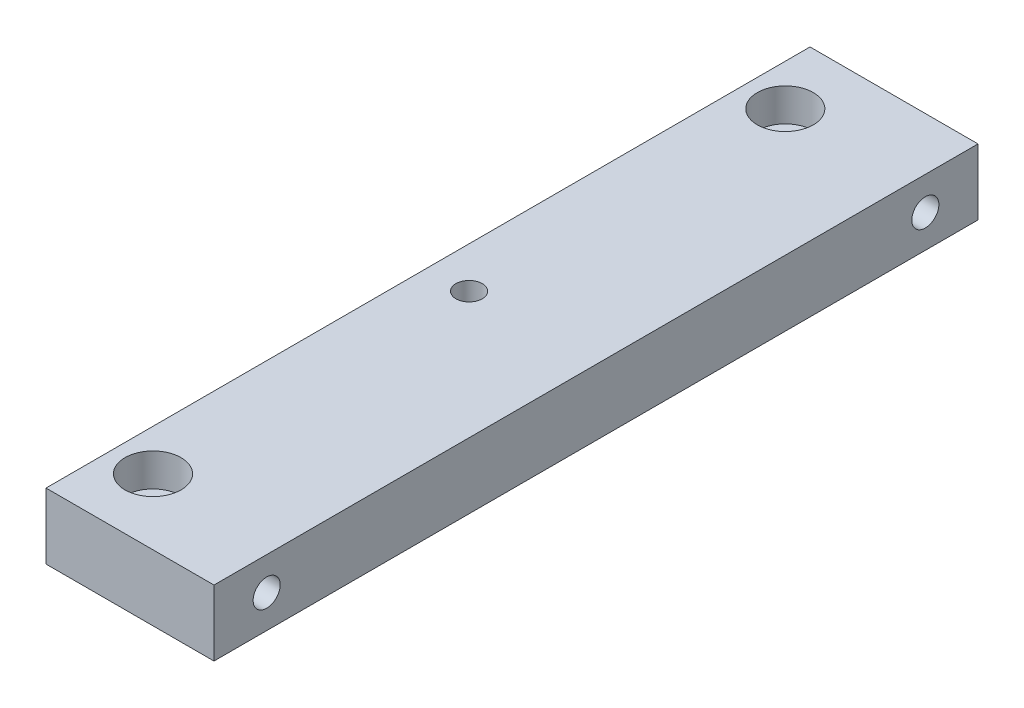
ISO-10303-21;
HEADER;
FILE_DESCRIPTION(('STEP AP214'),'2;1');
FILE_NAME('part.step','',(''),(''),'','','');
FILE_SCHEMA(('AUTOMOTIVE_DESIGN { 1 0 10303 214 1 1 1 1 }'));
ENDSEC;
DATA;
#1=APPLICATION_CONTEXT('core data for automotive mechanical design processes');
#2=APPLICATION_PROTOCOL_DEFINITION('international standard','automotive_design',2000,#1);
#3=PRODUCT_CONTEXT('',#1,'mechanical');
#4=PRODUCT('Part','Part','',(#3));
#5=PRODUCT_RELATED_PRODUCT_CATEGORY('part','',(#4));
#6=PRODUCT_DEFINITION_FORMATION('','',#4);
#7=PRODUCT_DEFINITION_CONTEXT('part definition',#1,'design');
#8=PRODUCT_DEFINITION('design','',#6,#7);
#9=PRODUCT_DEFINITION_SHAPE('','',#8);
#10=(LENGTH_UNIT() NAMED_UNIT(*) SI_UNIT(.MILLI.,.METRE.));
#11=(NAMED_UNIT(*) PLANE_ANGLE_UNIT() SI_UNIT($,.RADIAN.));
#12=(NAMED_UNIT(*) SI_UNIT($,.STERADIAN.) SOLID_ANGLE_UNIT());
#13=UNCERTAINTY_MEASURE_WITH_UNIT(LENGTH_MEASURE(1.E-05),#10,'distance_accuracy_value','');
#14=(GEOMETRIC_REPRESENTATION_CONTEXT(3) GLOBAL_UNCERTAINTY_ASSIGNED_CONTEXT((#13)) GLOBAL_UNIT_ASSIGNED_CONTEXT((#10,
#11,#12)) REPRESENTATION_CONTEXT('',''));
#15=CARTESIAN_POINT('',(0.,0.,0.));
#16=DIRECTION('',(0.,0.,1.));
#17=DIRECTION('',(1.,0.,0.));
#18=AXIS2_PLACEMENT_3D('',#15,#16,#17);
#19=CARTESIAN_POINT('',(20.2438,7.9375,-92.075));
#20=DIRECTION('',(-1.,0.,0.));
#21=DIRECTION('',(0.,0.,1.));
#22=AXIS2_PLACEMENT_3D('',#19,#20,#21);
#23=PLANE('',#22);
#24=CARTESIAN_POINT('',(20.2438,0.,-79.375));
#25=DIRECTION('',(1.,0.,0.));
#26=DIRECTION('',(0.,0.,-1.));
#27=AXIS2_PLACEMENT_3D('',#24,#25,#26);
#28=CIRCLE('',#27,3.2639);
#29=CARTESIAN_POINT('',(20.2438,0.,-82.6389));
#30=VERTEX_POINT('',#29);
#31=EDGE_CURVE('E104',#30,#30,#28,.T.);
#32=ORIENTED_EDGE('',*,*,#31,.F.);
#33=EDGE_LOOP('',(#32));
#34=FACE_BOUND('',#33,.T.);
#35=CARTESIAN_POINT('',(20.2438,0.,79.375));
#36=DIRECTION('',(1.,0.,0.));
#37=DIRECTION('',(0.,0.,-1.));
#38=AXIS2_PLACEMENT_3D('',#35,#36,#37);
#39=CIRCLE('',#38,3.2639);
#40=CARTESIAN_POINT('',(20.2438,0.,76.1111));
#41=VERTEX_POINT('',#40);
#42=EDGE_CURVE('E103',#41,#41,#39,.T.);
#43=ORIENTED_EDGE('',*,*,#42,.F.);
#44=EDGE_LOOP('',(#43));
#45=FACE_BOUND('',#44,.T.);
#46=DIRECTION('',(0.,0.,-1.));
#47=VECTOR('',#46,1.);
#48=CARTESIAN_POINT('',(20.2438,-7.9375,-92.075));
#49=LINE('',#48,#47);
#50=CARTESIAN_POINT('',(20.2438,-7.9375,92.075));
#51=VERTEX_POINT('',#50);
#52=CARTESIAN_POINT('',(20.2438,-7.9375,-92.075));
#53=VERTEX_POINT('',#52);
#54=EDGE_CURVE('E144',#51,#53,#49,.T.);
#55=ORIENTED_EDGE('',*,*,#54,.T.);
#56=DIRECTION('',(0.,-1.,0.));
#57=VECTOR('',#56,1.);
#58=CARTESIAN_POINT('',(20.2438,7.9375,-92.075));
#59=LINE('',#58,#57);
#60=CARTESIAN_POINT('',(20.2438,7.9375,-92.075));
#61=VERTEX_POINT('',#60);
#62=EDGE_CURVE('E11',#61,#53,#59,.T.);
#63=ORIENTED_EDGE('',*,*,#62,.F.);
#64=DIRECTION('',(0.,0.,-1.));
#65=VECTOR('',#64,1.);
#66=CARTESIAN_POINT('',(20.2438,7.9375,-92.075));
#67=LINE('',#66,#65);
#68=CARTESIAN_POINT('',(20.2438,7.9375,92.075));
#69=VERTEX_POINT('',#68);
#70=EDGE_CURVE('E145',#69,#61,#67,.T.);
#71=ORIENTED_EDGE('',*,*,#70,.F.);
#72=DIRECTION('',(0.,-1.,0.));
#73=VECTOR('',#72,1.);
#74=CARTESIAN_POINT('',(20.2438,7.9375,92.075));
#75=LINE('',#74,#73);
#76=EDGE_CURVE('E151',#69,#51,#75,.T.);
#77=ORIENTED_EDGE('',*,*,#76,.T.);
#78=EDGE_LOOP('',(#55,#63,#71,#77));
#79=FACE_BOUND('',#78,.T.);
#80=ADVANCED_FACE('F39',(#34,#45,#79),#23,.F.);
#81=CARTESIAN_POINT('',(-20.2438,7.9375,-92.075));
#82=DIRECTION('',(0.,0.,1.));
#83=DIRECTION('',(1.,0.,0.));
#84=AXIS2_PLACEMENT_3D('',#81,#82,#83);
#85=PLANE('',#84);
#86=DIRECTION('',(-1.,0.,0.));
#87=VECTOR('',#86,1.);
#88=CARTESIAN_POINT('',(-20.2438,-7.9375,-92.075));
#89=LINE('',#88,#87);
#90=CARTESIAN_POINT('',(-20.2438,-7.9375,-92.075));
#91=VERTEX_POINT('',#90);
#92=EDGE_CURVE('E154',#53,#91,#89,.T.);
#93=ORIENTED_EDGE('',*,*,#92,.T.);
#94=DIRECTION('',(0.,-1.,0.));
#95=VECTOR('',#94,1.);
#96=CARTESIAN_POINT('',(-20.2438,7.9375,-92.075));
#97=LINE('',#96,#95);
#98=CARTESIAN_POINT('',(-20.2438,7.9375,-92.075));
#99=VERTEX_POINT('',#98);
#100=EDGE_CURVE('E47',#99,#91,#97,.T.);
#101=ORIENTED_EDGE('',*,*,#100,.F.);
#102=DIRECTION('',(-1.,0.,0.));
#103=VECTOR('',#102,1.);
#104=CARTESIAN_POINT('',(-20.2438,7.9375,-92.075));
#105=LINE('',#104,#103);
#106=EDGE_CURVE('E86',#61,#99,#105,.T.);
#107=ORIENTED_EDGE('',*,*,#106,.F.);
#108=ORIENTED_EDGE('',*,*,#62,.T.);
#109=EDGE_LOOP('',(#93,#101,#107,#108));
#110=FACE_BOUND('',#109,.T.);
#111=ADVANCED_FACE('F178',(#110),#85,.F.);
#112=CARTESIAN_POINT('',(-20.2438,7.9375,-92.075));
#113=DIRECTION('',(1.,0.,0.));
#114=DIRECTION('',(0.,0.,-1.));
#115=AXIS2_PLACEMENT_3D('',#112,#113,#114);
#116=PLANE('',#115);
#117=DIRECTION('',(0.,0.,1.));
#118=VECTOR('',#117,1.);
#119=CARTESIAN_POINT('',(-20.2438,-7.9375,-92.075));
#120=LINE('',#119,#118);
#121=CARTESIAN_POINT('',(-20.2438,-7.9375,92.075));
#122=VERTEX_POINT('',#121);
#123=EDGE_CURVE('E73',#91,#122,#120,.T.);
#124=ORIENTED_EDGE('',*,*,#123,.T.);
#125=DIRECTION('',(0.,-1.,0.));
#126=VECTOR('',#125,1.);
#127=CARTESIAN_POINT('',(-20.2438,7.9375,92.075));
#128=LINE('',#127,#126);
#129=CARTESIAN_POINT('',(-20.2438,7.9375,92.075));
#130=VERTEX_POINT('',#129);
#131=EDGE_CURVE('E159',#130,#122,#128,.T.);
#132=ORIENTED_EDGE('',*,*,#131,.F.);
#133=DIRECTION('',(0.,0.,1.));
#134=VECTOR('',#133,1.);
#135=CARTESIAN_POINT('',(-20.2438,7.9375,-92.075));
#136=LINE('',#135,#134);
#137=EDGE_CURVE('E148',#99,#130,#136,.T.);
#138=ORIENTED_EDGE('',*,*,#137,.F.);
#139=ORIENTED_EDGE('',*,*,#100,.T.);
#140=EDGE_LOOP('',(#124,#132,#138,#139));
#141=FACE_BOUND('',#140,.T.);
#142=ADVANCED_FACE('F161',(#141),#116,.F.);
#143=CARTESIAN_POINT('',(-20.2438,7.9375,92.075));
#144=DIRECTION('',(0.,0.,-1.));
#145=DIRECTION('',(-1.,0.,0.));
#146=AXIS2_PLACEMENT_3D('',#143,#144,#145);
#147=PLANE('',#146);
#148=DIRECTION('',(1.,0.,0.));
#149=VECTOR('',#148,1.);
#150=CARTESIAN_POINT('',(-20.2438,-7.9375,92.075));
#151=LINE('',#150,#149);
#152=EDGE_CURVE('E79',#122,#51,#151,.T.);
#153=ORIENTED_EDGE('',*,*,#152,.T.);
#154=ORIENTED_EDGE('',*,*,#76,.F.);
#155=DIRECTION('',(1.,0.,0.));
#156=VECTOR('',#155,1.);
#157=CARTESIAN_POINT('',(-20.2438,7.9375,92.075));
#158=LINE('',#157,#156);
#159=EDGE_CURVE('E55',#130,#69,#158,.T.);
#160=ORIENTED_EDGE('',*,*,#159,.F.);
#161=ORIENTED_EDGE('',*,*,#131,.T.);
#162=EDGE_LOOP('',(#153,#154,#160,#161));
#163=FACE_BOUND('',#162,.T.);
#164=ADVANCED_FACE('F168',(#163),#147,.F.);
#165=CARTESIAN_POINT('',(0.,7.9375,0.));
#166=DIRECTION('',(0.,1.,0.));
#167=DIRECTION('',(0.,0.,1.));
#168=AXIS2_PLACEMENT_3D('',#165,#166,#167);
#169=PLANE('',#168);
#170=CARTESIAN_POINT('',(-10.3362074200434,7.9375,1.07876481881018E-11));
#171=DIRECTION('',(0.,-1.,0.));
#172=DIRECTION('',(0.,0.,-1.));
#173=AXIS2_PLACEMENT_3D('',#170,#171,#172);
#174=CIRCLE('',#173,3.175);
#175=CARTESIAN_POINT('',(-10.3362074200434,7.9375,-3.17499999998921));
#176=VERTEX_POINT('',#175);
#177=EDGE_CURVE('E117',#176,#176,#174,.T.);
#178=ORIENTED_EDGE('',*,*,#177,.T.);
#179=EDGE_LOOP('',(#178));
#180=FACE_BOUND('',#179,.T.);
#181=CARTESIAN_POINT('',(-10.3235074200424,7.9375,76.2000000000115));
#182=DIRECTION('',(0.,1.,0.));
#183=DIRECTION('',(0.,0.,1.));
#184=AXIS2_PLACEMENT_3D('',#181,#182,#183);
#185=CIRCLE('',#184,6.74751);
#186=CARTESIAN_POINT('',(-10.3235074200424,7.9375,82.9475100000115));
#187=VERTEX_POINT('',#186);
#188=EDGE_CURVE('E120',#187,#187,#185,.T.);
#189=ORIENTED_EDGE('',*,*,#188,.F.);
#190=EDGE_LOOP('',(#189));
#191=FACE_BOUND('',#190,.T.);
#192=CARTESIAN_POINT('',(-10.3235074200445,7.9375,-76.1999999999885));
#193=DIRECTION('',(0.,1.,0.));
#194=DIRECTION('',(0.,0.,1.));
#195=AXIS2_PLACEMENT_3D('',#192,#193,#194);
#196=CIRCLE('',#195,6.74751);
#197=CARTESIAN_POINT('',(-10.3235074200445,7.9375,-69.4524899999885));
#198=VERTEX_POINT('',#197);
#199=EDGE_CURVE('E132',#198,#198,#196,.T.);
#200=ORIENTED_EDGE('',*,*,#199,.F.);
#201=EDGE_LOOP('',(#200));
#202=FACE_BOUND('',#201,.T.);
#203=ORIENTED_EDGE('',*,*,#70,.T.);
#204=ORIENTED_EDGE('',*,*,#106,.T.);
#205=ORIENTED_EDGE('',*,*,#137,.T.);
#206=ORIENTED_EDGE('',*,*,#159,.T.);
#207=EDGE_LOOP('',(#203,#204,#205,#206));
#208=FACE_BOUND('',#207,.T.);
#209=ADVANCED_FACE('F170',(#180,#191,#202,#208),#169,.T.);
#210=CARTESIAN_POINT('',(0.,-7.9375,0.));
#211=DIRECTION('',(0.,1.,0.));
#212=DIRECTION('',(0.,0.,1.));
#213=AXIS2_PLACEMENT_3D('',#210,#211,#212);
#214=PLANE('',#213);
#215=CARTESIAN_POINT('',(-10.3362074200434,-7.9375,1.07876481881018E-11));
#216=DIRECTION('',(0.,-1.,0.));
#217=DIRECTION('',(0.,0.,-1.));
#218=AXIS2_PLACEMENT_3D('',#215,#216,#217);
#219=CIRCLE('',#218,3.175);
#220=CARTESIAN_POINT('',(-10.3362074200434,-7.9375,-3.17499999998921));
#221=VERTEX_POINT('',#220);
#222=EDGE_CURVE('E114',#221,#221,#219,.T.);
#223=ORIENTED_EDGE('',*,*,#222,.F.);
#224=EDGE_LOOP('',(#223));
#225=FACE_BOUND('',#224,.T.);
#226=CARTESIAN_POINT('',(-10.3235074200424,-7.9375,76.2000000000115));
#227=DIRECTION('',(0.,1.,0.));
#228=DIRECTION('',(0.,0.,1.));
#229=AXIS2_PLACEMENT_3D('',#226,#227,#228);
#230=CIRCLE('',#229,4.2164);
#231=CARTESIAN_POINT('',(-10.3235074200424,-7.9375,80.4164000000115));
#232=VERTEX_POINT('',#231);
#233=EDGE_CURVE('E129',#232,#232,#230,.T.);
#234=ORIENTED_EDGE('',*,*,#233,.T.);
#235=EDGE_LOOP('',(#234));
#236=FACE_BOUND('',#235,.T.);
#237=CARTESIAN_POINT('',(-10.3235074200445,-7.9375,-76.1999999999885));
#238=DIRECTION('',(0.,1.,0.));
#239=DIRECTION('',(0.,0.,1.));
#240=AXIS2_PLACEMENT_3D('',#237,#238,#239);
#241=CIRCLE('',#240,4.2164);
#242=CARTESIAN_POINT('',(-10.3235074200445,-7.9375,-71.9835999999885));
#243=VERTEX_POINT('',#242);
#244=EDGE_CURVE('E141',#243,#243,#241,.T.);
#245=ORIENTED_EDGE('',*,*,#244,.T.);
#246=EDGE_LOOP('',(#245));
#247=FACE_BOUND('',#246,.T.);
#248=ORIENTED_EDGE('',*,*,#54,.F.);
#249=ORIENTED_EDGE('',*,*,#152,.F.);
#250=ORIENTED_EDGE('',*,*,#123,.F.);
#251=ORIENTED_EDGE('',*,*,#92,.F.);
#252=EDGE_LOOP('',(#248,#249,#250,#251));
#253=FACE_BOUND('',#252,.T.);
#254=ADVANCED_FACE('F164',(#225,#236,#247,#253),#214,.F.);
#255=CARTESIAN_POINT('',(-10.3235074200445,7.9375,-76.1999999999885));
#256=DIRECTION('',(0.,1.,0.));
#257=DIRECTION('',(0.,0.,1.));
#258=AXIS2_PLACEMENT_3D('',#255,#256,#257);
#259=CYLINDRICAL_SURFACE('',#258,4.2164);
#260=ORIENTED_EDGE('',*,*,#244,.F.);
#261=EDGE_LOOP('',(#260));
#262=FACE_BOUND('',#261,.T.);
#263=CARTESIAN_POINT('',(-10.3235074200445,0.,-76.1999999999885));
#264=DIRECTION('',(0.,1.,0.));
#265=DIRECTION('',(0.,0.,1.));
#266=AXIS2_PLACEMENT_3D('',#263,#264,#265);
#267=CIRCLE('',#266,4.2164);
#268=CARTESIAN_POINT('',(-10.3235074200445,0.,-71.9835999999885));
#269=VERTEX_POINT('',#268);
#270=EDGE_CURVE('E138',#269,#269,#267,.T.);
#271=ORIENTED_EDGE('',*,*,#270,.T.);
#272=EDGE_LOOP('',(#271));
#273=FACE_BOUND('',#272,.T.);
#274=ADVANCED_FACE('F225',(#262,#273),#259,.F.);
#275=CARTESIAN_POINT('',(-6.10710742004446,0.,-76.1999999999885));
#276=DIRECTION('',(0.,-1.,0.));
#277=DIRECTION('',(0.,0.,-1.));
#278=AXIS2_PLACEMENT_3D('',#275,#276,#277);
#279=PLANE('',#278);
#280=ORIENTED_EDGE('',*,*,#270,.F.);
#281=EDGE_LOOP('',(#280));
#282=FACE_BOUND('',#281,.T.);
#283=CARTESIAN_POINT('',(-10.3235074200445,0.,-76.1999999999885));
#284=DIRECTION('',(0.,1.,0.));
#285=DIRECTION('',(0.,0.,1.));
#286=AXIS2_PLACEMENT_3D('',#283,#284,#285);
#287=CIRCLE('',#286,6.74751);
#288=CARTESIAN_POINT('',(-10.3235074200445,0.,-69.4524899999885));
#289=VERTEX_POINT('',#288);
#290=EDGE_CURVE('E135',#289,#289,#287,.T.);
#291=ORIENTED_EDGE('',*,*,#290,.T.);
#292=EDGE_LOOP('',(#291));
#293=FACE_BOUND('',#292,.T.);
#294=ADVANCED_FACE('F221',(#282,#293),#279,.F.);
#295=CARTESIAN_POINT('',(-10.3235074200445,7.9375,-76.1999999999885));
#296=DIRECTION('',(0.,1.,0.));
#297=DIRECTION('',(0.,0.,1.));
#298=AXIS2_PLACEMENT_3D('',#295,#296,#297);
#299=CYLINDRICAL_SURFACE('',#298,6.74751);
#300=ORIENTED_EDGE('',*,*,#290,.F.);
#301=EDGE_LOOP('',(#300));
#302=FACE_BOUND('',#301,.T.);
#303=ORIENTED_EDGE('',*,*,#199,.T.);
#304=EDGE_LOOP('',(#303));
#305=FACE_BOUND('',#304,.T.);
#306=ADVANCED_FACE('F217',(#302,#305),#299,.F.);
#307=CARTESIAN_POINT('',(-10.3235074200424,7.9375,76.2000000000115));
#308=DIRECTION('',(0.,1.,0.));
#309=DIRECTION('',(0.,0.,1.));
#310=AXIS2_PLACEMENT_3D('',#307,#308,#309);
#311=CYLINDRICAL_SURFACE('',#310,4.2164);
#312=ORIENTED_EDGE('',*,*,#233,.F.);
#313=EDGE_LOOP('',(#312));
#314=FACE_BOUND('',#313,.T.);
#315=CARTESIAN_POINT('',(-10.3235074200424,0.,76.2000000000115));
#316=DIRECTION('',(0.,1.,0.));
#317=DIRECTION('',(0.,0.,1.));
#318=AXIS2_PLACEMENT_3D('',#315,#316,#317);
#319=CIRCLE('',#318,4.2164);
#320=CARTESIAN_POINT('',(-10.3235074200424,0.,80.4164000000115));
#321=VERTEX_POINT('',#320);
#322=EDGE_CURVE('E126',#321,#321,#319,.T.);
#323=ORIENTED_EDGE('',*,*,#322,.T.);
#324=EDGE_LOOP('',(#323));
#325=FACE_BOUND('',#324,.T.);
#326=ADVANCED_FACE('F213',(#314,#325),#311,.F.);
#327=CARTESIAN_POINT('',(-6.10710742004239,0.,76.2000000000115));
#328=DIRECTION('',(0.,-1.,0.));
#329=DIRECTION('',(0.,0.,-1.));
#330=AXIS2_PLACEMENT_3D('',#327,#328,#329);
#331=PLANE('',#330);
#332=ORIENTED_EDGE('',*,*,#322,.F.);
#333=EDGE_LOOP('',(#332));
#334=FACE_BOUND('',#333,.T.);
#335=CARTESIAN_POINT('',(-10.3235074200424,0.,76.2000000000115));
#336=DIRECTION('',(0.,1.,0.));
#337=DIRECTION('',(0.,0.,1.));
#338=AXIS2_PLACEMENT_3D('',#335,#336,#337);
#339=CIRCLE('',#338,6.74751);
#340=CARTESIAN_POINT('',(-10.3235074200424,0.,82.9475100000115));
#341=VERTEX_POINT('',#340);
#342=EDGE_CURVE('E123',#341,#341,#339,.T.);
#343=ORIENTED_EDGE('',*,*,#342,.T.);
#344=EDGE_LOOP('',(#343));
#345=FACE_BOUND('',#344,.T.);
#346=ADVANCED_FACE('F209',(#334,#345),#331,.F.);
#347=CARTESIAN_POINT('',(-10.3235074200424,7.9375,76.2000000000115));
#348=DIRECTION('',(0.,1.,0.));
#349=DIRECTION('',(0.,0.,1.));
#350=AXIS2_PLACEMENT_3D('',#347,#348,#349);
#351=CYLINDRICAL_SURFACE('',#350,6.74751);
#352=ORIENTED_EDGE('',*,*,#342,.F.);
#353=EDGE_LOOP('',(#352));
#354=FACE_BOUND('',#353,.T.);
#355=ORIENTED_EDGE('',*,*,#188,.T.);
#356=EDGE_LOOP('',(#355));
#357=FACE_BOUND('',#356,.T.);
#358=ADVANCED_FACE('F205',(#354,#357),#351,.F.);
#359=CARTESIAN_POINT('',(-10.3362074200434,-7.9375,1.07876481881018E-11));
#360=DIRECTION('',(0.,-1.,0.));
#361=DIRECTION('',(0.,0.,-1.));
#362=AXIS2_PLACEMENT_3D('',#359,#360,#361);
#363=CYLINDRICAL_SURFACE('',#362,3.175);
#364=ORIENTED_EDGE('',*,*,#177,.F.);
#365=EDGE_LOOP('',(#364));
#366=FACE_BOUND('',#365,.T.);
#367=ORIENTED_EDGE('',*,*,#222,.T.);
#368=EDGE_LOOP('',(#367));
#369=FACE_BOUND('',#368,.T.);
#370=ADVANCED_FACE('F197',(#366,#369),#363,.F.);
#371=CARTESIAN_POINT('',(-0.0762000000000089,0.,79.375));
#372=DIRECTION('',(1.,0.,0.));
#373=DIRECTION('',(0.,0.,-1.));
#374=AXIS2_PLACEMENT_3D('',#371,#372,#373);
#375=CONICAL_SURFACE('',#374,3.2639,1.02974425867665);
#376=CARTESIAN_POINT('',(-2.03734897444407,0.,79.375));
#377=VERTEX_POINT('',#376);
#378=VERTEX_LOOP('',#377);
#379=FACE_BOUND('',#378,.T.);
#380=CARTESIAN_POINT('',(-0.0762000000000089,0.,79.375));
#381=DIRECTION('',(1.,0.,0.));
#382=DIRECTION('',(0.,0.,-1.));
#383=AXIS2_PLACEMENT_3D('',#380,#381,#382);
#384=CIRCLE('',#383,3.2639);
#385=CARTESIAN_POINT('',(-0.0762000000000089,0.,76.1111));
#386=VERTEX_POINT('',#385);
#387=EDGE_CURVE('E107',#386,#386,#384,.T.);
#388=ORIENTED_EDGE('',*,*,#387,.T.);
#389=EDGE_LOOP('',(#388));
#390=FACE_BOUND('',#389,.T.);
#391=ADVANCED_FACE('F191',(#379,#390),#375,.F.);
#392=CARTESIAN_POINT('',(20.2438,0.,79.375));
#393=DIRECTION('',(1.,0.,0.));
#394=DIRECTION('',(0.,0.,-1.));
#395=AXIS2_PLACEMENT_3D('',#392,#393,#394);
#396=CYLINDRICAL_SURFACE('',#395,3.2639);
#397=ORIENTED_EDGE('',*,*,#387,.F.);
#398=EDGE_LOOP('',(#397));
#399=FACE_BOUND('',#398,.T.);
#400=ORIENTED_EDGE('',*,*,#42,.T.);
#401=EDGE_LOOP('',(#400));
#402=FACE_BOUND('',#401,.T.);
#403=ADVANCED_FACE('F97',(#399,#402),#396,.F.);
#404=CARTESIAN_POINT('',(-0.0762000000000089,0.,-79.375));
#405=DIRECTION('',(1.,0.,0.));
#406=DIRECTION('',(0.,0.,-1.));
#407=AXIS2_PLACEMENT_3D('',#404,#405,#406);
#408=CONICAL_SURFACE('',#407,3.2639,1.02974425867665);
#409=CARTESIAN_POINT('',(-2.03734897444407,0.,-79.375));
#410=VERTEX_POINT('',#409);
#411=VERTEX_LOOP('',#410);
#412=FACE_BOUND('',#411,.T.);
#413=CARTESIAN_POINT('',(-0.0762000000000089,0.,-79.375));
#414=DIRECTION('',(1.,0.,0.));
#415=DIRECTION('',(0.,0.,-1.));
#416=AXIS2_PLACEMENT_3D('',#413,#414,#415);
#417=CIRCLE('',#416,3.2639);
#418=CARTESIAN_POINT('',(-0.0762000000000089,0.,-82.6389));
#419=VERTEX_POINT('',#418);
#420=EDGE_CURVE('E101',#419,#419,#417,.T.);
#421=ORIENTED_EDGE('',*,*,#420,.T.);
#422=EDGE_LOOP('',(#421));
#423=FACE_BOUND('',#422,.T.);
#424=ADVANCED_FACE('F93',(#412,#423),#408,.F.);
#425=CARTESIAN_POINT('',(20.2438,0.,-79.375));
#426=DIRECTION('',(1.,0.,0.));
#427=DIRECTION('',(0.,0.,-1.));
#428=AXIS2_PLACEMENT_3D('',#425,#426,#427);
#429=CYLINDRICAL_SURFACE('',#428,3.2639);
#430=ORIENTED_EDGE('',*,*,#420,.F.);
#431=EDGE_LOOP('',(#430));
#432=FACE_BOUND('',#431,.T.);
#433=ORIENTED_EDGE('',*,*,#31,.T.);
#434=EDGE_LOOP('',(#433));
#435=FACE_BOUND('',#434,.T.);
#436=ADVANCED_FACE('F96',(#432,#435),#429,.F.);
#437=CLOSED_SHELL('',(#80,#111,#142,#164,#209,#254,#274,#294,#306,#326,#346,#358,#370,#391,#403,
#424,#436));
#438=MANIFOLD_SOLID_BREP('B2',#437);
#439=ADVANCED_BREP_SHAPE_REPRESENTATION('',(#18,#438),#14);
#440=SHAPE_DEFINITION_REPRESENTATION(#9,#439);
ENDSEC;
END-ISO-10303-21;
